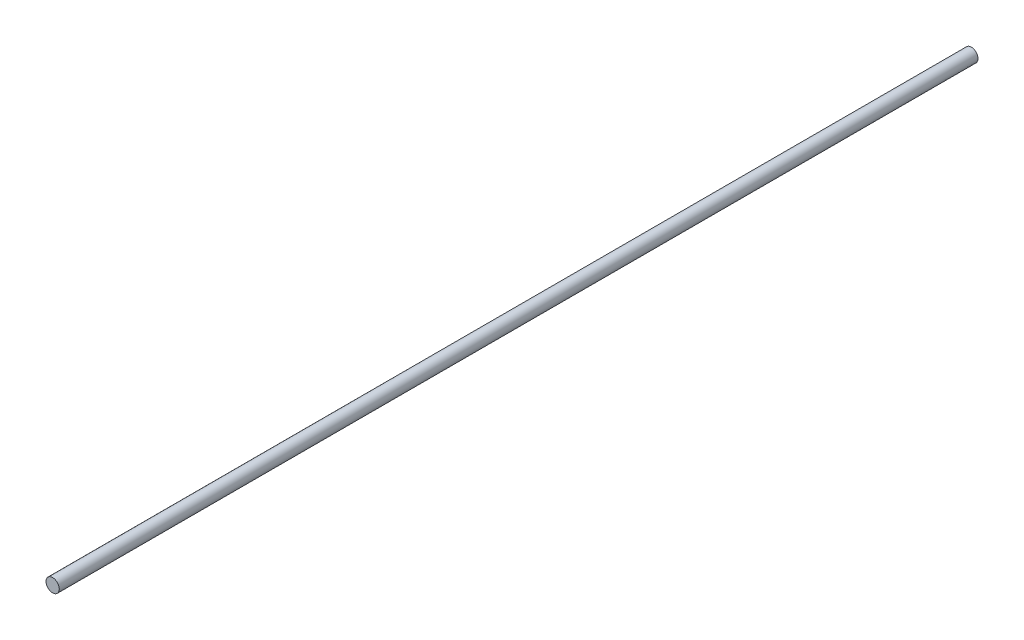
from build123d import *

# Parameters (mm, degrees)
SKETCH1_R           = 30
BOSS_EXTRUDE1_DEPTH = 4150


with BuildPart() as part:
    # Sketch1 → Boss-Extrude1 (new body)
    with BuildSketch(Plane.XY):
        Circle(SKETCH1_R)
    extrude(amount=-BOSS_EXTRUDE1_DEPTH)


solid = part.part
